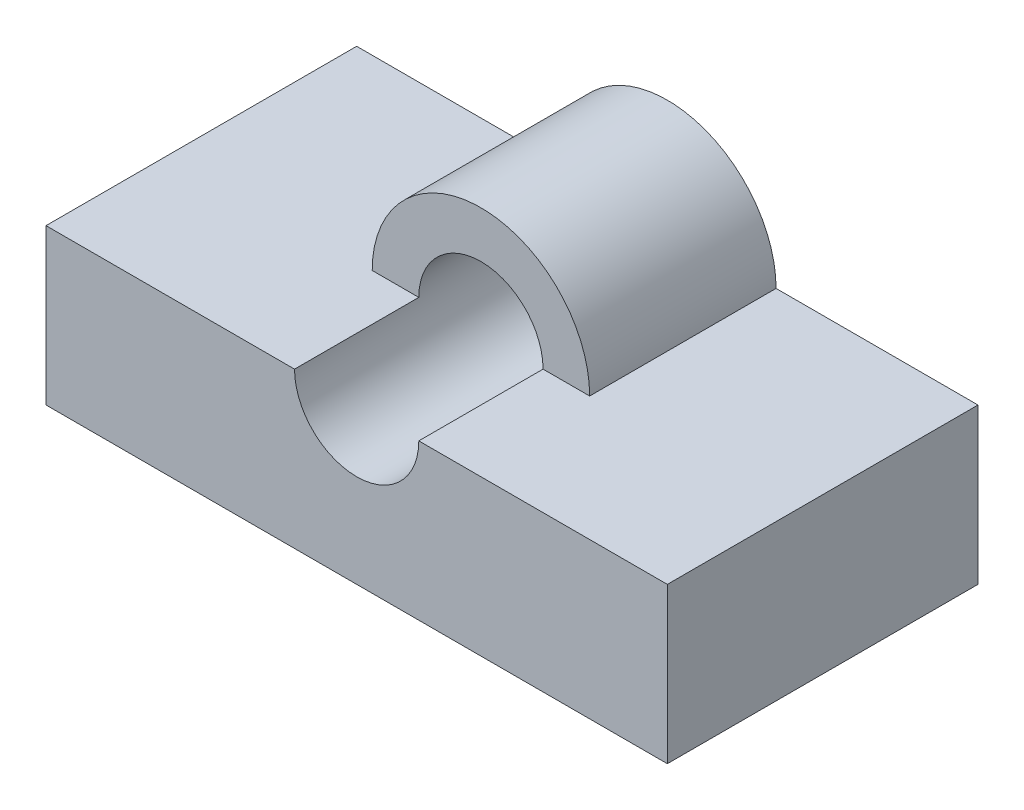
ISO-10303-21;
HEADER;
FILE_DESCRIPTION(('STEP AP214'),'2;1');
FILE_NAME('part.step','',(''),(''),'','','');
FILE_SCHEMA(('AUTOMOTIVE_DESIGN { 1 0 10303 214 1 1 1 1 }'));
ENDSEC;
DATA;
#1=APPLICATION_CONTEXT('core data for automotive mechanical design processes');
#2=APPLICATION_PROTOCOL_DEFINITION('international standard','automotive_design',2000,#1);
#3=PRODUCT_CONTEXT('',#1,'mechanical');
#4=PRODUCT('Part','Part','',(#3));
#5=PRODUCT_RELATED_PRODUCT_CATEGORY('part','',(#4));
#6=PRODUCT_DEFINITION_FORMATION('','',#4);
#7=PRODUCT_DEFINITION_CONTEXT('part definition',#1,'design');
#8=PRODUCT_DEFINITION('design','',#6,#7);
#9=PRODUCT_DEFINITION_SHAPE('','',#8);
#10=(LENGTH_UNIT() NAMED_UNIT(*) SI_UNIT(.MILLI.,.METRE.));
#11=(NAMED_UNIT(*) PLANE_ANGLE_UNIT() SI_UNIT($,.RADIAN.));
#12=(NAMED_UNIT(*) SI_UNIT($,.STERADIAN.) SOLID_ANGLE_UNIT());
#13=UNCERTAINTY_MEASURE_WITH_UNIT(LENGTH_MEASURE(1.E-05),#10,'distance_accuracy_value','');
#14=(GEOMETRIC_REPRESENTATION_CONTEXT(3) GLOBAL_UNCERTAINTY_ASSIGNED_CONTEXT((#13)) GLOBAL_UNIT_ASSIGNED_CONTEXT((#10,
#11,#12)) REPRESENTATION_CONTEXT('',''));
#15=CARTESIAN_POINT('',(0.,0.,0.));
#16=DIRECTION('',(0.,0.,1.));
#17=DIRECTION('',(1.,0.,0.));
#18=AXIS2_PLACEMENT_3D('',#15,#16,#17);
#19=CARTESIAN_POINT('',(50.,25.,50.));
#20=DIRECTION('',(0.,1.,0.));
#21=DIRECTION('',(0.,0.,1.));
#22=AXIS2_PLACEMENT_3D('',#19,#20,#21);
#23=PLANE('',#22);
#24=DIRECTION('',(1.,0.,0.));
#25=VECTOR('',#24,1.);
#26=CARTESIAN_POINT('',(50.,25.,0.));
#27=LINE('',#26,#25);
#28=CARTESIAN_POINT('',(67.5,25.,0.));
#29=VERTEX_POINT('',#28);
#30=CARTESIAN_POINT('',(100.,25.,0.));
#31=VERTEX_POINT('',#30);
#32=EDGE_CURVE('E118',#29,#31,#27,.T.);
#33=ORIENTED_EDGE('',*,*,#32,.F.);
#34=DIRECTION('',(0.,0.,-1.));
#35=VECTOR('',#34,1.);
#36=CARTESIAN_POINT('',(67.5,25.,30.));
#37=LINE('',#36,#35);
#38=CARTESIAN_POINT('',(67.5,25.,30.));
#39=VERTEX_POINT('',#38);
#40=EDGE_CURVE('E99',#39,#29,#37,.T.);
#41=ORIENTED_EDGE('',*,*,#40,.F.);
#42=DIRECTION('',(1.,0.,0.));
#43=VECTOR('',#42,1.);
#44=CARTESIAN_POINT('',(50.,25.,30.));
#45=LINE('',#44,#43);
#46=CARTESIAN_POINT('',(60.,25.,30.));
#47=VERTEX_POINT('',#46);
#48=EDGE_CURVE('E129',#47,#39,#45,.T.);
#49=ORIENTED_EDGE('',*,*,#48,.F.);
#50=DIRECTION('',(0.,0.,-1.));
#51=VECTOR('',#50,1.);
#52=CARTESIAN_POINT('',(60.,25.,50.));
#53=LINE('',#52,#51);
#54=CARTESIAN_POINT('',(60.,25.,50.));
#55=VERTEX_POINT('',#54);
#56=EDGE_CURVE('E11',#55,#47,#53,.T.);
#57=ORIENTED_EDGE('',*,*,#56,.F.);
#58=DIRECTION('',(1.,0.,0.));
#59=VECTOR('',#58,1.);
#60=CARTESIAN_POINT('',(50.,25.,50.));
#61=LINE('',#60,#59);
#62=CARTESIAN_POINT('',(100.,25.,50.));
#63=VERTEX_POINT('',#62);
#64=EDGE_CURVE('E158',#55,#63,#61,.T.);
#65=ORIENTED_EDGE('',*,*,#64,.T.);
#66=DIRECTION('',(0.,0.,-1.));
#67=VECTOR('',#66,1.);
#68=CARTESIAN_POINT('',(100.,25.,50.));
#69=LINE('',#68,#67);
#70=EDGE_CURVE('E148',#63,#31,#69,.T.);
#71=ORIENTED_EDGE('',*,*,#70,.T.);
#72=EDGE_LOOP('',(#33,#41,#49,#57,#65,#71));
#73=FACE_BOUND('',#72,.T.);
#74=ADVANCED_FACE('F28',(#73),#23,.T.);
#75=CARTESIAN_POINT('',(32.5,25.,30.));
#76=VERTEX_POINT('',#75);
#77=CARTESIAN_POINT('',(40.,25.,30.));
#78=VERTEX_POINT('',#77);
#79=EDGE_CURVE('E109',#76,#78,#45,.T.);
#80=ORIENTED_EDGE('',*,*,#79,.F.);
#81=DIRECTION('',(0.,0.,-1.));
#82=VECTOR('',#81,1.);
#83=CARTESIAN_POINT('',(32.5,25.,30.));
#84=LINE('',#83,#82);
#85=CARTESIAN_POINT('',(32.5,25.,0.));
#86=VERTEX_POINT('',#85);
#87=EDGE_CURVE('E96',#76,#86,#84,.T.);
#88=ORIENTED_EDGE('',*,*,#87,.T.);
#89=CARTESIAN_POINT('',(0.,25.,0.));
#90=VERTEX_POINT('',#89);
#91=EDGE_CURVE('E106',#90,#86,#27,.T.);
#92=ORIENTED_EDGE('',*,*,#91,.F.);
#93=DIRECTION('',(0.,0.,-1.));
#94=VECTOR('',#93,1.);
#95=CARTESIAN_POINT('',(0.,25.,50.));
#96=LINE('',#95,#94);
#97=CARTESIAN_POINT('',(0.,25.,50.));
#98=VERTEX_POINT('',#97);
#99=EDGE_CURVE('E140',#98,#90,#96,.T.);
#100=ORIENTED_EDGE('',*,*,#99,.F.);
#101=CARTESIAN_POINT('',(40.,25.,50.));
#102=VERTEX_POINT('',#101);
#103=EDGE_CURVE('E139',#98,#102,#61,.T.);
#104=ORIENTED_EDGE('',*,*,#103,.T.);
#105=DIRECTION('',(0.,0.,-1.));
#106=VECTOR('',#105,1.);
#107=CARTESIAN_POINT('',(40.,25.,50.));
#108=LINE('',#107,#106);
#109=EDGE_CURVE('E36',#102,#78,#108,.T.);
#110=ORIENTED_EDGE('',*,*,#109,.T.);
#111=EDGE_LOOP('',(#80,#88,#92,#100,#104,#110));
#112=FACE_BOUND('',#111,.T.);
#113=ADVANCED_FACE('F105',(#112),#23,.T.);
#114=CARTESIAN_POINT('',(50.,25.,50.));
#115=DIRECTION('',(0.,0.,-1.));
#116=DIRECTION('',(-1.,0.,0.));
#117=AXIS2_PLACEMENT_3D('',#114,#115,#116);
#118=CYLINDRICAL_SURFACE('',#117,10.);
#119=CARTESIAN_POINT('',(50.,25.,0.));
#120=DIRECTION('',(0.,0.,1.));
#121=DIRECTION('',(1.,0.,0.));
#122=AXIS2_PLACEMENT_3D('',#119,#120,#121);
#123=CIRCLE('',#122,10.);
#124=CARTESIAN_POINT('',(60.,25.,0.));
#125=VERTEX_POINT('',#124);
#126=EDGE_CURVE('E116',#125,#125,#123,.T.);
#127=ORIENTED_EDGE('',*,*,#126,.F.);
#128=EDGE_LOOP('',(#127));
#129=FACE_BOUND('',#128,.T.);
#130=ORIENTED_EDGE('',*,*,#56,.T.);
#131=CARTESIAN_POINT('',(50.,25.,30.));
#132=DIRECTION('',(0.,0.,1.));
#133=DIRECTION('',(1.,0.,0.));
#134=AXIS2_PLACEMENT_3D('',#131,#132,#133);
#135=CIRCLE('',#134,10.);
#136=EDGE_CURVE('E101',#47,#78,#135,.T.);
#137=ORIENTED_EDGE('',*,*,#136,.T.);
#138=ORIENTED_EDGE('',*,*,#109,.F.);
#139=CARTESIAN_POINT('',(50.,25.,50.));
#140=DIRECTION('',(0.,0.,1.));
#141=DIRECTION('',(1.,0.,0.));
#142=AXIS2_PLACEMENT_3D('',#139,#140,#141);
#143=CIRCLE('',#142,10.);
#144=EDGE_CURVE('E156',#102,#55,#143,.T.);
#145=ORIENTED_EDGE('',*,*,#144,.T.);
#146=EDGE_LOOP('',(#130,#137,#138,#145));
#147=FACE_BOUND('',#146,.T.);
#148=ADVANCED_FACE('F30',(#129,#147),#118,.F.);
#149=CARTESIAN_POINT('',(0.,-67.8170099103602,50.));
#150=DIRECTION('',(-1.,0.,0.));
#151=DIRECTION('',(0.,0.,1.));
#152=AXIS2_PLACEMENT_3D('',#149,#150,#151);
#153=PLANE('',#152);
#154=DIRECTION('',(0.,1.,0.));
#155=VECTOR('',#154,1.);
#156=CARTESIAN_POINT('',(0.,-67.8170099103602,0.));
#157=LINE('',#156,#155);
#158=CARTESIAN_POINT('',(0.,0.,0.));
#159=VERTEX_POINT('',#158);
#160=EDGE_CURVE('E115',#159,#90,#157,.T.);
#161=ORIENTED_EDGE('',*,*,#160,.F.);
#162=DIRECTION('',(0.,0.,-1.));
#163=VECTOR('',#162,1.);
#164=CARTESIAN_POINT('',(0.,0.,50.));
#165=LINE('',#164,#163);
#166=CARTESIAN_POINT('',(0.,0.,50.));
#167=VERTEX_POINT('',#166);
#168=EDGE_CURVE('E141',#167,#159,#165,.T.);
#169=ORIENTED_EDGE('',*,*,#168,.F.);
#170=DIRECTION('',(0.,1.,0.));
#171=VECTOR('',#170,1.);
#172=CARTESIAN_POINT('',(0.,-67.8170099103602,50.));
#173=LINE('',#172,#171);
#174=EDGE_CURVE('E153',#167,#98,#173,.T.);
#175=ORIENTED_EDGE('',*,*,#174,.T.);
#176=ORIENTED_EDGE('',*,*,#99,.T.);
#177=EDGE_LOOP('',(#161,#169,#175,#176));
#178=FACE_BOUND('',#177,.T.);
#179=ADVANCED_FACE('F174',(#178),#153,.T.);
#180=CARTESIAN_POINT('',(50.,0.,50.));
#181=DIRECTION('',(0.,1.,0.));
#182=DIRECTION('',(0.,0.,1.));
#183=AXIS2_PLACEMENT_3D('',#180,#181,#182);
#184=PLANE('',#183);
#185=DIRECTION('',(1.,0.,0.));
#186=VECTOR('',#185,1.);
#187=CARTESIAN_POINT('',(50.,0.,0.));
#188=LINE('',#187,#186);
#189=CARTESIAN_POINT('',(100.,0.,0.));
#190=VERTEX_POINT('',#189);
#191=EDGE_CURVE('E119',#159,#190,#188,.T.);
#192=ORIENTED_EDGE('',*,*,#191,.T.);
#193=DIRECTION('',(0.,0.,-1.));
#194=VECTOR('',#193,1.);
#195=CARTESIAN_POINT('',(100.,0.,50.));
#196=LINE('',#195,#194);
#197=CARTESIAN_POINT('',(100.,0.,50.));
#198=VERTEX_POINT('',#197);
#199=EDGE_CURVE('E145',#198,#190,#196,.T.);
#200=ORIENTED_EDGE('',*,*,#199,.F.);
#201=DIRECTION('',(1.,0.,0.));
#202=VECTOR('',#201,1.);
#203=CARTESIAN_POINT('',(50.,0.,50.));
#204=LINE('',#203,#202);
#205=EDGE_CURVE('E151',#167,#198,#204,.T.);
#206=ORIENTED_EDGE('',*,*,#205,.F.);
#207=ORIENTED_EDGE('',*,*,#168,.T.);
#208=EDGE_LOOP('',(#192,#200,#206,#207));
#209=FACE_BOUND('',#208,.T.);
#210=ADVANCED_FACE('F166',(#209),#184,.F.);
#211=CARTESIAN_POINT('',(100.,-67.8170099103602,50.));
#212=DIRECTION('',(-1.,0.,0.));
#213=DIRECTION('',(0.,0.,1.));
#214=AXIS2_PLACEMENT_3D('',#211,#212,#213);
#215=PLANE('',#214);
#216=DIRECTION('',(0.,1.,0.));
#217=VECTOR('',#216,1.);
#218=CARTESIAN_POINT('',(100.,-67.8170099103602,0.));
#219=LINE('',#218,#217);
#220=EDGE_CURVE('E161',#190,#31,#219,.T.);
#221=ORIENTED_EDGE('',*,*,#220,.T.);
#222=ORIENTED_EDGE('',*,*,#70,.F.);
#223=DIRECTION('',(0.,1.,0.));
#224=VECTOR('',#223,1.);
#225=CARTESIAN_POINT('',(100.,-67.8170099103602,50.));
#226=LINE('',#225,#224);
#227=EDGE_CURVE('E51',#198,#63,#226,.T.);
#228=ORIENTED_EDGE('',*,*,#227,.F.);
#229=ORIENTED_EDGE('',*,*,#199,.T.);
#230=EDGE_LOOP('',(#221,#222,#228,#229));
#231=FACE_BOUND('',#230,.T.);
#232=ADVANCED_FACE('F169',(#231),#215,.F.);
#233=CARTESIAN_POINT('',(50.,-67.8170099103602,50.));
#234=DIRECTION('',(0.,0.,1.));
#235=DIRECTION('',(1.,0.,0.));
#236=AXIS2_PLACEMENT_3D('',#233,#234,#235);
#237=PLANE('',#236);
#238=ORIENTED_EDGE('',*,*,#64,.F.);
#239=ORIENTED_EDGE('',*,*,#144,.F.);
#240=ORIENTED_EDGE('',*,*,#103,.F.);
#241=ORIENTED_EDGE('',*,*,#174,.F.);
#242=ORIENTED_EDGE('',*,*,#205,.T.);
#243=ORIENTED_EDGE('',*,*,#227,.T.);
#244=EDGE_LOOP('',(#238,#239,#240,#241,#242,#243));
#245=FACE_BOUND('',#244,.T.);
#246=ADVANCED_FACE('F171',(#245),#237,.T.);
#247=CARTESIAN_POINT('',(50.,-67.8170099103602,0.));
#248=DIRECTION('',(0.,0.,1.));
#249=DIRECTION('',(1.,0.,0.));
#250=AXIS2_PLACEMENT_3D('',#247,#248,#249);
#251=PLANE('',#250);
#252=CARTESIAN_POINT('',(50.,25.,0.));
#253=DIRECTION('',(0.,0.,1.));
#254=DIRECTION('',(1.,0.,0.));
#255=AXIS2_PLACEMENT_3D('',#252,#253,#254);
#256=CIRCLE('',#255,17.5);
#257=EDGE_CURVE('E43',#29,#86,#256,.T.);
#258=ORIENTED_EDGE('',*,*,#257,.F.);
#259=ORIENTED_EDGE('',*,*,#32,.T.);
#260=ORIENTED_EDGE('',*,*,#220,.F.);
#261=ORIENTED_EDGE('',*,*,#191,.F.);
#262=ORIENTED_EDGE('',*,*,#160,.T.);
#263=ORIENTED_EDGE('',*,*,#91,.T.);
#264=EDGE_LOOP('',(#258,#259,#260,#261,#262,#263));
#265=FACE_BOUND('',#264,.T.);
#266=ORIENTED_EDGE('',*,*,#126,.T.);
#267=EDGE_LOOP('',(#266));
#268=FACE_BOUND('',#267,.T.);
#269=ADVANCED_FACE('F111',(#265,#268),#251,.F.);
#270=CARTESIAN_POINT('',(50.,25.,30.));
#271=DIRECTION('',(0.,0.,-1.));
#272=DIRECTION('',(-1.,0.,0.));
#273=AXIS2_PLACEMENT_3D('',#270,#271,#272);
#274=CYLINDRICAL_SURFACE('',#273,17.5);
#275=ORIENTED_EDGE('',*,*,#257,.T.);
#276=ORIENTED_EDGE('',*,*,#87,.F.);
#277=CARTESIAN_POINT('',(50.,25.,30.));
#278=DIRECTION('',(0.,0.,1.));
#279=DIRECTION('',(1.,0.,0.));
#280=AXIS2_PLACEMENT_3D('',#277,#278,#279);
#281=CIRCLE('',#280,17.5);
#282=EDGE_CURVE('E127',#39,#76,#281,.T.);
#283=ORIENTED_EDGE('',*,*,#282,.F.);
#284=ORIENTED_EDGE('',*,*,#40,.T.);
#285=EDGE_LOOP('',(#275,#276,#283,#284));
#286=FACE_BOUND('',#285,.T.);
#287=ADVANCED_FACE('F94',(#286),#274,.T.);
#288=CARTESIAN_POINT('',(50.,-67.8170099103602,30.));
#289=DIRECTION('',(0.,0.,1.));
#290=DIRECTION('',(1.,0.,0.));
#291=AXIS2_PLACEMENT_3D('',#288,#289,#290);
#292=PLANE('',#291);
#293=ORIENTED_EDGE('',*,*,#136,.F.);
#294=ORIENTED_EDGE('',*,*,#48,.T.);
#295=ORIENTED_EDGE('',*,*,#282,.T.);
#296=ORIENTED_EDGE('',*,*,#79,.T.);
#297=EDGE_LOOP('',(#293,#294,#295,#296));
#298=FACE_BOUND('',#297,.T.);
#299=ADVANCED_FACE('F208',(#298),#292,.T.);
#300=CLOSED_SHELL('',(#74,#113,#148,#179,#210,#232,#246,#269,#287,#299));
#301=MANIFOLD_SOLID_BREP('B2',#300);
#302=ADVANCED_BREP_SHAPE_REPRESENTATION('',(#18,#301),#14);
#303=SHAPE_DEFINITION_REPRESENTATION(#9,#302);
ENDSEC;
END-ISO-10303-21;
